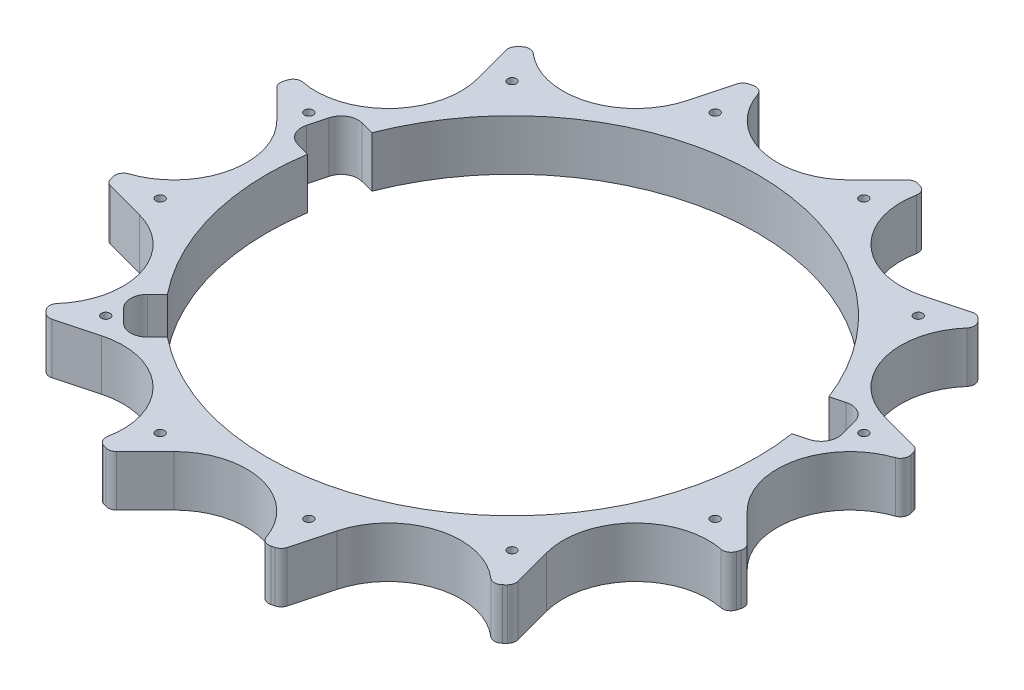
from build123d import *

# Parameters (mm, degrees)
SKETCH1_R                   = 123.825
BOSS_EXTRUDE1_DEPTH         = 19.05
CUT_EXTRUDE1_DEPTH          = 177.148130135
FILLET2_R                   = 3.175
CIRPATTERN1_COUNT           = 12
FILLET2_OF_CIRPATTERN1_R    = 3.175
SKETCH5_R                   = 92.075
CUT_EXTRUDE5_DEPTH          = 172.229866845
TAP_DRILL_FOR_M4X0_7_TAP1_D = 3.3
CIRPATTERN2_COUNT           = 12
CUT_EXTRUDE7_DEPTH          = 172.229866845
CIRPATTERN4_COUNT           = 12


with BuildPart() as part:
    # Sketch1 → Boss-Extrude1 (new body)
    with BuildSketch(Plane(origin=(0, 0, 0), x_dir=(1, 0, 0), z_dir=(0, 1, 0))):
        with Locations(Location((0, 0, 0), (0, 0, 90))):
            Circle(SKETCH1_R)
    extrude(amount=BOSS_EXTRUDE1_DEPTH)

    # Sketch2 → Cut-Extrude1 (cut, through all)
    with BuildSketch(Plane(origin=(0, 19.05, 0), x_dir=(1, 0, 0), z_dir=(0, 1, 0))):
        with BuildLine():
            Line((-26.374604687, 134.067054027), (-12.068494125, 187.458185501))
            Line((-12.068494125, 187.458185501), (58.392571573, 146.777470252))
            Line((58.392571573, 146.777470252), (19.30755066, 107.69244934))
            ThreePointArc((19.30755066, 107.69244934), (-13.6525, 103.35317635), (-26.374604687, 134.067054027))
        make_face()
    cut_extrude1 = extrude(amount=-CUT_EXTRUDE1_DEPTH, mode=Mode.SUBTRACT)

    # Fillet2
    fillet2_edges = [part.edges().sort_by_distance(p)[0] for p in [
        (-26.621623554, 9.525, -120.9294),
        (31.394207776, 9.525, -119.779106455),
    ]]
    fillet(fillet2_edges, radius=FILLET2_R)

    # CirPattern1: Cut-Extrude1 ×12 about axis
    cirpattern1_axis = Axis((0, 0, 0), (0, 1, 0))
    for i in range(1, CIRPATTERN1_COUNT):
        add(cut_extrude1.rotate(cirpattern1_axis, i * 360 / CIRPATTERN1_COUNT), mode=Mode.SUBTRACT)

    # Fillet2 of CirPattern1
    fillet2_of_cirpattern1_edges = [part.edges().sort_by_distance(p)[0] for p in [
        (-83.519702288, 9.525, -91.417120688),
        (-32.701371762, 9.525, -119.42885292),
        (-118.038744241, 9.525, -37.409697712),
        (-88.034645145, 9.525, -87.077734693),
        (-120.9294, 9.525, 26.621623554),
        (-119.779106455, 9.525, -31.394207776),
        (-91.417120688, 9.525, 83.519702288),
        (-119.42885292, 9.525, 32.701371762),
        (-37.409697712, 9.525, 118.038744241),
        (-87.077734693, 9.525, 88.034645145),
        (26.621623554, 9.525, 120.9294),
        (-31.394207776, 9.525, 119.779106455),
        (83.519702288, 9.525, 91.417120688),
        (32.701371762, 9.525, 119.42885292),
        (118.038744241, 9.525, 37.409697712),
        (88.034645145, 9.525, 87.077734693),
        (120.9294, 9.525, -26.621623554),
        (119.779106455, 9.525, 31.394207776),
        (91.417120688, 9.525, -83.519702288),
        (119.42885292, 9.525, -32.701371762),
        (37.409697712, 9.525, -118.038744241),
        (87.077734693, 9.525, -88.034645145),
    ]]
    fillet(fillet2_of_cirpattern1_edges, radius=FILLET2_OF_CIRPATTERN1_R)

    # Sketch5 → Cut-Extrude5 (cut, through all)
    with BuildSketch(Plane(origin=(0, 0, 0), x_dir=(1, 0, 0), z_dir=(0, 1, 0))):
        with Locations(Location((0, 0, 0), (0, 0, 90))):
            Circle(SKETCH5_R)
    extrude(amount=CUT_EXTRUDE5_DEPTH, mode=Mode.SUBTRACT)

    # Tap Drill for M4x0.7 Tap1 (through all)
    with Locations(Plane(origin=(0, 19.05, 0), x_dir=(1, 0, 0), z_dir=(0, 1, 0))):
        with Locations((27.939515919, 104.271692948)):
            tap_drill_for_m4x0_7_tap1 = Hole(TAP_DRILL_FOR_M4X0_7_TAP1_D / 2)

    # CirPattern2: Tap Drill for M4x0.7 Tap1 ×12 about axis
    cirpattern2_axis = Axis((0, 0, 0), (0, 1, 0))
    for i in range(1, CIRPATTERN2_COUNT):
        add(tap_drill_for_m4x0_7_tap1.rotate(cirpattern2_axis, i * 360 / CIRPATTERN2_COUNT), mode=Mode.SUBTRACT)

    # Sketch9 → Cut-Extrude7 (cut, through all)
    with BuildSketch(Plane.XZ):
        with BuildLine():
            Line((2.547426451, 9.507124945), (96.085268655, -15.556264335))
            ThreePointArc((96.085268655, -15.556264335), (99.941029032, -18.514893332), (100.575396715, -23.333394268))
            Line((100.575396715, -23.333394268), (98.767545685, -30.080386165))
            ThreePointArc((98.767545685, -30.080386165), (95.808916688, -33.936146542), (90.990415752, -34.570514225))
            Line((90.990415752, -34.570514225), (-2.547426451, -9.507124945))
            Line((-2.547426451, -9.507124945), (2.547426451, 9.507124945))
        make_face()
    cut_extrude7 = extrude(amount=-CUT_EXTRUDE7_DEPTH, mode=Mode.SUBTRACT)

    # CirPattern4: Cut-Extrude7 ×12 about axis, 9 skipped
    cirpattern4_axis = Axis((0, 19.05, 0), (0, -1, 0))
    add([cut_extrude7.rotate(cirpattern4_axis, i * 360 / CIRPATTERN4_COUNT) for i in range(1, CIRPATTERN4_COUNT) if i not in (1, 2, 3, 4, 6, 8, 9, 10, 11)], mode=Mode.SUBTRACT)


solid = part.part
